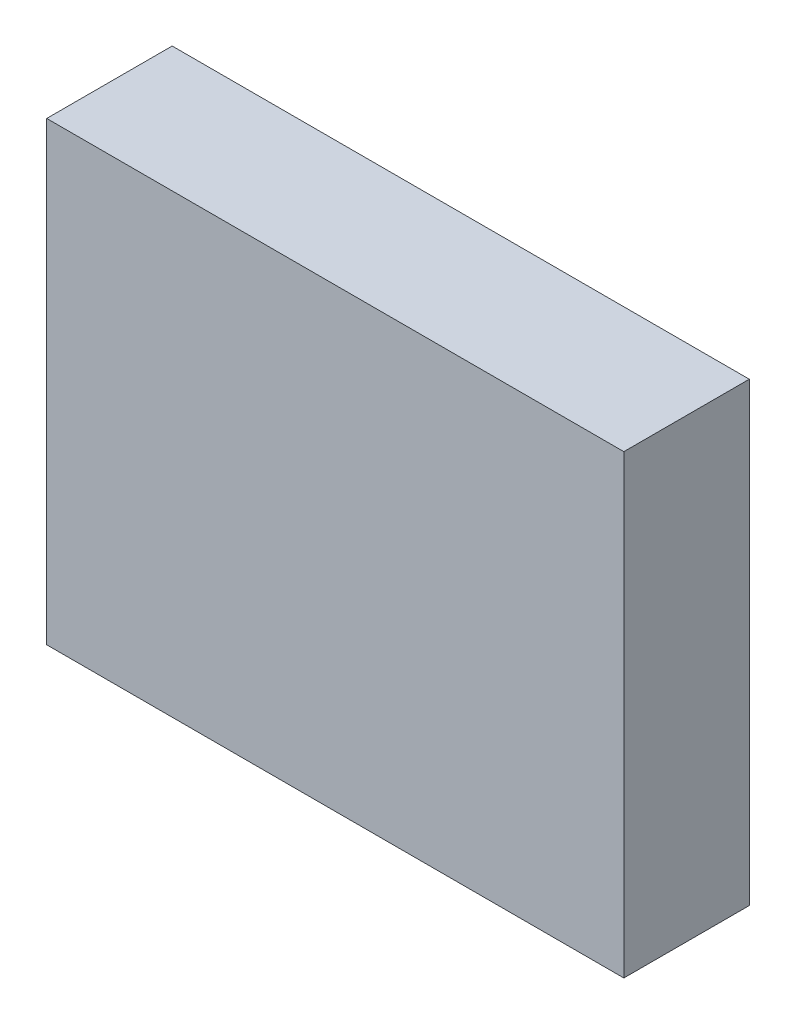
from build123d import *

# Parameters (mm, degrees)
ESQUISSE1_W        = 138
ESQUISSE1_H        = 109
BOSS_EXTRU_1_DEPTH = 30


with BuildPart() as part:
    # Esquisse1 → Boss.-Extru.1 (new body)
    with BuildSketch(Plane.XY):
        with Locations((11.598278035, -12.300276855)):
            Rectangle(ESQUISSE1_W, ESQUISSE1_H)
    extrude(amount=BOSS_EXTRU_1_DEPTH)


solid = part.part
